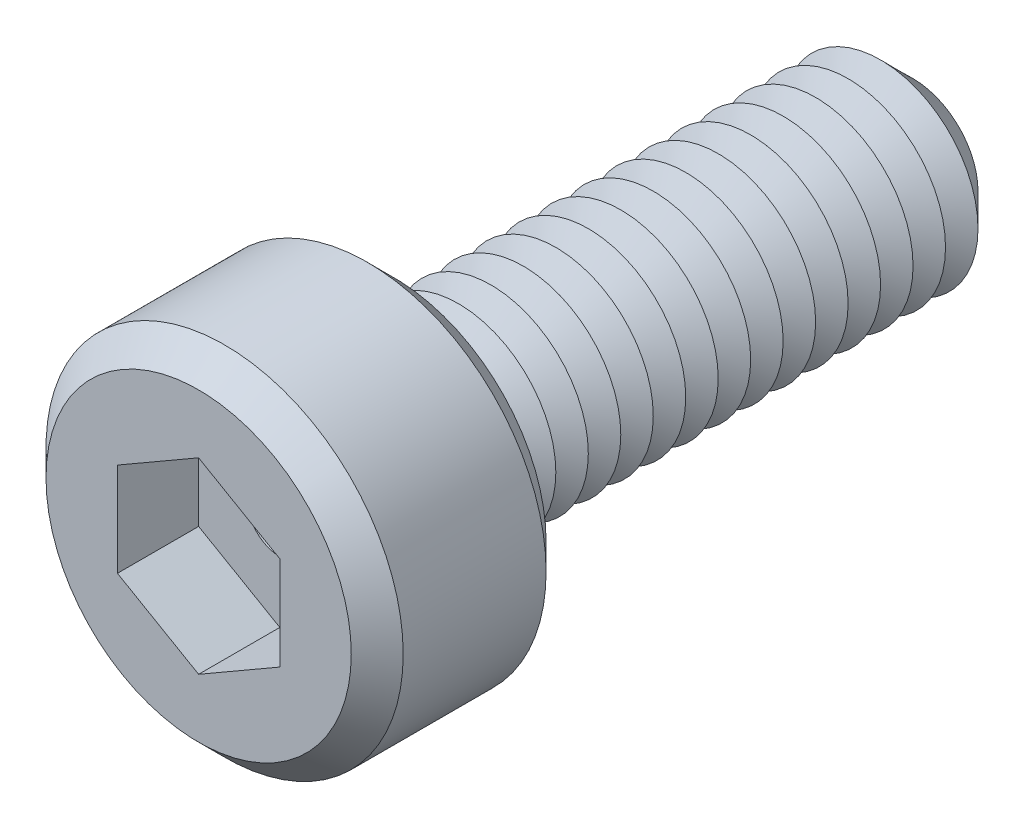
ISO-10303-21;
HEADER;
FILE_DESCRIPTION(('STEP AP214'),'2;1');
FILE_NAME('part.step','',(''),(''),'','','');
FILE_SCHEMA(('AUTOMOTIVE_DESIGN { 1 0 10303 214 1 1 1 1 }'));
ENDSEC;
DATA;
#1=APPLICATION_CONTEXT('core data for automotive mechanical design processes');
#2=APPLICATION_PROTOCOL_DEFINITION('international standard','automotive_design',2000,#1);
#3=PRODUCT_CONTEXT('',#1,'mechanical');
#4=PRODUCT('Part','Part','',(#3));
#5=PRODUCT_RELATED_PRODUCT_CATEGORY('part','',(#4));
#6=PRODUCT_DEFINITION_FORMATION('','',#4);
#7=PRODUCT_DEFINITION_CONTEXT('part definition',#1,'design');
#8=PRODUCT_DEFINITION('design','',#6,#7);
#9=PRODUCT_DEFINITION_SHAPE('','',#8);
#10=(LENGTH_UNIT() NAMED_UNIT(*) SI_UNIT(.MILLI.,.METRE.));
#11=(NAMED_UNIT(*) PLANE_ANGLE_UNIT() SI_UNIT($,.RADIAN.));
#12=(NAMED_UNIT(*) SI_UNIT($,.STERADIAN.) SOLID_ANGLE_UNIT());
#13=UNCERTAINTY_MEASURE_WITH_UNIT(LENGTH_MEASURE(1.E-05),#10,'distance_accuracy_value','');
#14=(GEOMETRIC_REPRESENTATION_CONTEXT(3) GLOBAL_UNCERTAINTY_ASSIGNED_CONTEXT((#13)) GLOBAL_UNIT_ASSIGNED_CONTEXT((#10,
#11,#12)) REPRESENTATION_CONTEXT('',''));
#15=CARTESIAN_POINT('',(0.,0.,0.));
#16=DIRECTION('',(0.,0.,1.));
#17=DIRECTION('',(1.,0.,0.));
#18=AXIS2_PLACEMENT_3D('',#15,#16,#17);
#19=CARTESIAN_POINT('',(0.,0.,3.));
#20=DIRECTION('',(0.,0.,-1.));
#21=DIRECTION('',(-1.,0.,0.));
#22=AXIS2_PLACEMENT_3D('',#19,#20,#21);
#23=CYLINDRICAL_SURFACE('',#22,2.75);
#24=CARTESIAN_POINT('',(0.,0.,0.4));
#25=DIRECTION('',(0.,0.,1.));
#26=DIRECTION('',(1.,0.,0.));
#27=AXIS2_PLACEMENT_3D('',#24,#25,#26);
#28=CIRCLE('',#27,2.75);
#29=CARTESIAN_POINT('',(2.75,0.,0.4));
#30=VERTEX_POINT('',#29);
#31=EDGE_CURVE('E297',#30,#30,#28,.T.);
#32=ORIENTED_EDGE('',*,*,#31,.T.);
#33=EDGE_LOOP('',(#32));
#34=FACE_BOUND('',#33,.T.);
#35=CARTESIAN_POINT('',(0.,0.,2.6));
#36=DIRECTION('',(0.,0.,1.));
#37=DIRECTION('',(1.,0.,0.));
#38=AXIS2_PLACEMENT_3D('',#35,#36,#37);
#39=CIRCLE('',#38,2.75);
#40=CARTESIAN_POINT('',(2.75,0.,2.6));
#41=VERTEX_POINT('',#40);
#42=EDGE_CURVE('E293',#41,#41,#39,.F.);
#43=ORIENTED_EDGE('',*,*,#42,.T.);
#44=EDGE_LOOP('',(#43));
#45=FACE_BOUND('',#44,.T.);
#46=ADVANCED_FACE('F39',(#34,#45),#23,.T.);
#47=CARTESIAN_POINT('',(0.,0.,3.));
#48=DIRECTION('',(0.,0.,1.));
#49=DIRECTION('',(1.,0.,0.));
#50=AXIS2_PLACEMENT_3D('',#47,#48,#49);
#51=PLANE('',#50);
#52=CARTESIAN_POINT('',(0.,0.,3.));
#53=DIRECTION('',(0.,0.,1.));
#54=DIRECTION('',(1.,0.,0.));
#55=AXIS2_PLACEMENT_3D('',#52,#53,#54);
#56=CIRCLE('',#55,2.35);
#57=CARTESIAN_POINT('',(2.35,0.,3.));
#58=VERTEX_POINT('',#57);
#59=EDGE_CURVE('E11',#58,#58,#56,.T.);
#60=ORIENTED_EDGE('',*,*,#59,.T.);
#61=EDGE_LOOP('',(#60));
#62=FACE_BOUND('',#61,.T.);
#63=DIRECTION('',(-0.866025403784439,0.5,0.));
#64=VECTOR('',#63,1.);
#65=CARTESIAN_POINT('',(1.25,0.721687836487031,3.));
#66=LINE('',#65,#64);
#67=CARTESIAN_POINT('',(1.25,0.721687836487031,3.));
#68=VERTEX_POINT('',#67);
#69=CARTESIAN_POINT('',(0.,1.44337567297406,3.));
#70=VERTEX_POINT('',#69);
#71=EDGE_CURVE('E55',#68,#70,#66,.T.);
#72=ORIENTED_EDGE('',*,*,#71,.F.);
#73=DIRECTION('',(0.,1.,0.));
#74=VECTOR('',#73,1.);
#75=CARTESIAN_POINT('',(1.25,-0.721687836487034,3.));
#76=LINE('',#75,#74);
#77=CARTESIAN_POINT('',(1.25,-0.721687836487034,3.));
#78=VERTEX_POINT('',#77);
#79=EDGE_CURVE('E151',#78,#68,#76,.T.);
#80=ORIENTED_EDGE('',*,*,#79,.F.);
#81=DIRECTION('',(0.866025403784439,0.5,0.));
#82=VECTOR('',#81,1.);
#83=CARTESIAN_POINT('',(0.,-1.44337567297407,3.));
#84=LINE('',#83,#82);
#85=CARTESIAN_POINT('',(0.,-1.44337567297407,3.));
#86=VERTEX_POINT('',#85);
#87=EDGE_CURVE('E148',#86,#78,#84,.T.);
#88=ORIENTED_EDGE('',*,*,#87,.F.);
#89=DIRECTION('',(0.866025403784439,-0.5,0.));
#90=VECTOR('',#89,1.);
#91=CARTESIAN_POINT('',(-1.25,-0.721687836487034,3.));
#92=LINE('',#91,#90);
#93=CARTESIAN_POINT('',(-1.25,-0.721687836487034,3.));
#94=VERTEX_POINT('',#93);
#95=EDGE_CURVE('E103',#94,#86,#92,.T.);
#96=ORIENTED_EDGE('',*,*,#95,.F.);
#97=DIRECTION('',(0.,-1.,0.));
#98=VECTOR('',#97,1.);
#99=CARTESIAN_POINT('',(-1.25,0.721687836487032,3.));
#100=LINE('',#99,#98);
#101=CARTESIAN_POINT('',(-1.25,0.721687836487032,3.));
#102=VERTEX_POINT('',#101);
#103=EDGE_CURVE('E142',#102,#94,#100,.T.);
#104=ORIENTED_EDGE('',*,*,#103,.F.);
#105=DIRECTION('',(-0.866025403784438,-0.5,0.));
#106=VECTOR('',#105,1.);
#107=CARTESIAN_POINT('',(0.,1.44337567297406,3.));
#108=LINE('',#107,#106);
#109=EDGE_CURVE('E137',#70,#102,#108,.T.);
#110=ORIENTED_EDGE('',*,*,#109,.F.);
#111=EDGE_LOOP('',(#72,#80,#88,#96,#104,#110));
#112=FACE_BOUND('',#111,.T.);
#113=ADVANCED_FACE('F315',(#62,#112),#51,.T.);
#114=CARTESIAN_POINT('',(0.,0.,0.));
#115=DIRECTION('',(0.,0.,1.));
#116=DIRECTION('',(1.,0.,0.));
#117=AXIS2_PLACEMENT_3D('',#114,#115,#116);
#118=PLANE('',#117);
#119=CARTESIAN_POINT('',(0.,0.,0.));
#120=DIRECTION('',(0.,0.,1.));
#121=DIRECTION('',(1.,0.,0.));
#122=AXIS2_PLACEMENT_3D('',#119,#120,#121);
#123=CIRCLE('',#122,2.35);
#124=CARTESIAN_POINT('',(2.35,0.,0.));
#125=VERTEX_POINT('',#124);
#126=EDGE_CURVE('E48',#125,#125,#123,.F.);
#127=ORIENTED_EDGE('',*,*,#126,.T.);
#128=EDGE_LOOP('',(#127));
#129=FACE_BOUND('',#128,.T.);
#130=CARTESIAN_POINT('',(0.,0.,0.));
#131=DIRECTION('',(0.,0.,1.));
#132=DIRECTION('',(1.,0.,0.));
#133=AXIS2_PLACEMENT_3D('',#130,#131,#132);
#134=CIRCLE('',#133,1.5);
#135=CARTESIAN_POINT('',(1.5,0.,0.));
#136=VERTEX_POINT('',#135);
#137=EDGE_CURVE('E285',#136,#136,#134,.T.);
#138=ORIENTED_EDGE('',*,*,#137,.T.);
#139=EDGE_LOOP('',(#138));
#140=FACE_BOUND('',#139,.T.);
#141=ADVANCED_FACE('F304',(#129,#140),#118,.F.);
#142=CARTESIAN_POINT('',(0.,0.,0.));
#143=DIRECTION('',(0.,0.,1.));
#144=DIRECTION('',(1.,0.,0.));
#145=AXIS2_PLACEMENT_3D('',#142,#143,#144);
#146=CONICAL_SURFACE('',#145,1.5,1.0471975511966);
#147=CARTESIAN_POINT('',(0.,0.,-0.250000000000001));
#148=DIRECTION('',(0.,0.,1.));
#149=DIRECTION('',(1.,0.,0.));
#150=AXIS2_PLACEMENT_3D('',#147,#148,#149);
#151=CIRCLE('',#150,1.06698729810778);
#152=CARTESIAN_POINT('',(1.06698729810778,0.,-0.250000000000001));
#153=VERTEX_POINT('',#152);
#154=EDGE_CURVE('E281',#153,#153,#151,.T.);
#155=ORIENTED_EDGE('',*,*,#154,.T.);
#156=EDGE_LOOP('',(#155));
#157=FACE_BOUND('',#156,.T.);
#158=ORIENTED_EDGE('',*,*,#137,.F.);
#159=EDGE_LOOP('',(#158));
#160=FACE_BOUND('',#159,.T.);
#161=ADVANCED_FACE('F484',(#157,#160),#146,.T.);
#162=CARTESIAN_POINT('',(0.,0.,-0.250000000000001));
#163=DIRECTION('',(0.,0.,-1.));
#164=DIRECTION('',(-1.,0.,0.));
#165=AXIS2_PLACEMENT_3D('',#162,#163,#164);
#166=CONICAL_SURFACE('',#165,1.06698729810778,1.0471975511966);
#167=CARTESIAN_POINT('',(0.,0.,-0.5));
#168=DIRECTION('',(0.,0.,1.));
#169=DIRECTION('',(1.,0.,0.));
#170=AXIS2_PLACEMENT_3D('',#167,#168,#169);
#171=CIRCLE('',#170,1.5);
#172=CARTESIAN_POINT('',(1.5,0.,-0.5));
#173=VERTEX_POINT('',#172);
#174=EDGE_CURVE('E277',#173,#173,#171,.T.);
#175=ORIENTED_EDGE('',*,*,#174,.T.);
#176=EDGE_LOOP('',(#175));
#177=FACE_BOUND('',#176,.T.);
#178=ORIENTED_EDGE('',*,*,#154,.F.);
#179=EDGE_LOOP('',(#178));
#180=FACE_BOUND('',#179,.T.);
#181=ADVANCED_FACE('F480',(#177,#180),#166,.T.);
#182=CARTESIAN_POINT('',(0.,0.,-0.5));
#183=DIRECTION('',(0.,0.,1.));
#184=DIRECTION('',(1.,0.,0.));
#185=AXIS2_PLACEMENT_3D('',#182,#183,#184);
#186=CONICAL_SURFACE('',#185,1.5,1.0471975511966);
#187=CARTESIAN_POINT('',(0.,0.,-0.750000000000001));
#188=DIRECTION('',(0.,0.,1.));
#189=DIRECTION('',(1.,0.,0.));
#190=AXIS2_PLACEMENT_3D('',#187,#188,#189);
#191=CIRCLE('',#190,1.06698729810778);
#192=CARTESIAN_POINT('',(1.06698729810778,0.,-0.750000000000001));
#193=VERTEX_POINT('',#192);
#194=EDGE_CURVE('E273',#193,#193,#191,.T.);
#195=ORIENTED_EDGE('',*,*,#194,.T.);
#196=EDGE_LOOP('',(#195));
#197=FACE_BOUND('',#196,.T.);
#198=ORIENTED_EDGE('',*,*,#174,.F.);
#199=EDGE_LOOP('',(#198));
#200=FACE_BOUND('',#199,.T.);
#201=ADVANCED_FACE('F476',(#197,#200),#186,.T.);
#202=CARTESIAN_POINT('',(0.,0.,-0.750000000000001));
#203=DIRECTION('',(0.,0.,-1.));
#204=DIRECTION('',(-1.,0.,0.));
#205=AXIS2_PLACEMENT_3D('',#202,#203,#204);
#206=CONICAL_SURFACE('',#205,1.06698729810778,1.0471975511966);
#207=CARTESIAN_POINT('',(0.,0.,-1.));
#208=DIRECTION('',(0.,0.,1.));
#209=DIRECTION('',(1.,0.,0.));
#210=AXIS2_PLACEMENT_3D('',#207,#208,#209);
#211=CIRCLE('',#210,1.5);
#212=CARTESIAN_POINT('',(1.5,0.,-1.));
#213=VERTEX_POINT('',#212);
#214=EDGE_CURVE('E269',#213,#213,#211,.T.);
#215=ORIENTED_EDGE('',*,*,#214,.T.);
#216=EDGE_LOOP('',(#215));
#217=FACE_BOUND('',#216,.T.);
#218=ORIENTED_EDGE('',*,*,#194,.F.);
#219=EDGE_LOOP('',(#218));
#220=FACE_BOUND('',#219,.T.);
#221=ADVANCED_FACE('F472',(#217,#220),#206,.T.);
#222=CARTESIAN_POINT('',(0.,0.,-1.));
#223=DIRECTION('',(0.,0.,1.));
#224=DIRECTION('',(1.,0.,0.));
#225=AXIS2_PLACEMENT_3D('',#222,#223,#224);
#226=CONICAL_SURFACE('',#225,1.5,1.0471975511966);
#227=CARTESIAN_POINT('',(0.,0.,-1.25));
#228=DIRECTION('',(0.,0.,1.));
#229=DIRECTION('',(1.,0.,0.));
#230=AXIS2_PLACEMENT_3D('',#227,#228,#229);
#231=CIRCLE('',#230,1.06698729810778);
#232=CARTESIAN_POINT('',(1.06698729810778,0.,-1.25));
#233=VERTEX_POINT('',#232);
#234=EDGE_CURVE('E265',#233,#233,#231,.T.);
#235=ORIENTED_EDGE('',*,*,#234,.T.);
#236=EDGE_LOOP('',(#235));
#237=FACE_BOUND('',#236,.T.);
#238=ORIENTED_EDGE('',*,*,#214,.F.);
#239=EDGE_LOOP('',(#238));
#240=FACE_BOUND('',#239,.T.);
#241=ADVANCED_FACE('F468',(#237,#240),#226,.T.);
#242=CARTESIAN_POINT('',(0.,0.,-1.25));
#243=DIRECTION('',(0.,0.,-1.));
#244=DIRECTION('',(-1.,0.,0.));
#245=AXIS2_PLACEMENT_3D('',#242,#243,#244);
#246=CONICAL_SURFACE('',#245,1.06698729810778,1.0471975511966);
#247=CARTESIAN_POINT('',(0.,0.,-1.5));
#248=DIRECTION('',(0.,0.,1.));
#249=DIRECTION('',(1.,0.,0.));
#250=AXIS2_PLACEMENT_3D('',#247,#248,#249);
#251=CIRCLE('',#250,1.5);
#252=CARTESIAN_POINT('',(1.5,0.,-1.5));
#253=VERTEX_POINT('',#252);
#254=EDGE_CURVE('E261',#253,#253,#251,.T.);
#255=ORIENTED_EDGE('',*,*,#254,.T.);
#256=EDGE_LOOP('',(#255));
#257=FACE_BOUND('',#256,.T.);
#258=ORIENTED_EDGE('',*,*,#234,.F.);
#259=EDGE_LOOP('',(#258));
#260=FACE_BOUND('',#259,.T.);
#261=ADVANCED_FACE('F464',(#257,#260),#246,.T.);
#262=CARTESIAN_POINT('',(0.,0.,-1.5));
#263=DIRECTION('',(0.,0.,1.));
#264=DIRECTION('',(1.,0.,0.));
#265=AXIS2_PLACEMENT_3D('',#262,#263,#264);
#266=CONICAL_SURFACE('',#265,1.5,1.0471975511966);
#267=CARTESIAN_POINT('',(0.,0.,-1.75));
#268=DIRECTION('',(0.,0.,1.));
#269=DIRECTION('',(1.,0.,0.));
#270=AXIS2_PLACEMENT_3D('',#267,#268,#269);
#271=CIRCLE('',#270,1.06698729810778);
#272=CARTESIAN_POINT('',(1.06698729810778,0.,-1.75));
#273=VERTEX_POINT('',#272);
#274=EDGE_CURVE('E257',#273,#273,#271,.T.);
#275=ORIENTED_EDGE('',*,*,#274,.T.);
#276=EDGE_LOOP('',(#275));
#277=FACE_BOUND('',#276,.T.);
#278=ORIENTED_EDGE('',*,*,#254,.F.);
#279=EDGE_LOOP('',(#278));
#280=FACE_BOUND('',#279,.T.);
#281=ADVANCED_FACE('F460',(#277,#280),#266,.T.);
#282=CARTESIAN_POINT('',(0.,0.,-1.75));
#283=DIRECTION('',(0.,0.,-1.));
#284=DIRECTION('',(-1.,0.,0.));
#285=AXIS2_PLACEMENT_3D('',#282,#283,#284);
#286=CONICAL_SURFACE('',#285,1.06698729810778,1.0471975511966);
#287=CARTESIAN_POINT('',(0.,0.,-2.));
#288=DIRECTION('',(0.,0.,1.));
#289=DIRECTION('',(1.,0.,0.));
#290=AXIS2_PLACEMENT_3D('',#287,#288,#289);
#291=CIRCLE('',#290,1.5);
#292=CARTESIAN_POINT('',(1.5,0.,-2.));
#293=VERTEX_POINT('',#292);
#294=EDGE_CURVE('E253',#293,#293,#291,.T.);
#295=ORIENTED_EDGE('',*,*,#294,.T.);
#296=EDGE_LOOP('',(#295));
#297=FACE_BOUND('',#296,.T.);
#298=ORIENTED_EDGE('',*,*,#274,.F.);
#299=EDGE_LOOP('',(#298));
#300=FACE_BOUND('',#299,.T.);
#301=ADVANCED_FACE('F456',(#297,#300),#286,.T.);
#302=CARTESIAN_POINT('',(0.,0.,-2.));
#303=DIRECTION('',(0.,0.,1.));
#304=DIRECTION('',(1.,0.,0.));
#305=AXIS2_PLACEMENT_3D('',#302,#303,#304);
#306=CONICAL_SURFACE('',#305,1.5,1.0471975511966);
#307=CARTESIAN_POINT('',(0.,0.,-2.25));
#308=DIRECTION('',(0.,0.,1.));
#309=DIRECTION('',(1.,0.,0.));
#310=AXIS2_PLACEMENT_3D('',#307,#308,#309);
#311=CIRCLE('',#310,1.06698729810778);
#312=CARTESIAN_POINT('',(1.06698729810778,0.,-2.25));
#313=VERTEX_POINT('',#312);
#314=EDGE_CURVE('E249',#313,#313,#311,.T.);
#315=ORIENTED_EDGE('',*,*,#314,.T.);
#316=EDGE_LOOP('',(#315));
#317=FACE_BOUND('',#316,.T.);
#318=ORIENTED_EDGE('',*,*,#294,.F.);
#319=EDGE_LOOP('',(#318));
#320=FACE_BOUND('',#319,.T.);
#321=ADVANCED_FACE('F452',(#317,#320),#306,.T.);
#322=CARTESIAN_POINT('',(0.,0.,-2.25));
#323=DIRECTION('',(0.,0.,-1.));
#324=DIRECTION('',(-1.,0.,0.));
#325=AXIS2_PLACEMENT_3D('',#322,#323,#324);
#326=CONICAL_SURFACE('',#325,1.06698729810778,1.0471975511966);
#327=CARTESIAN_POINT('',(0.,0.,-2.5));
#328=DIRECTION('',(0.,0.,1.));
#329=DIRECTION('',(1.,0.,0.));
#330=AXIS2_PLACEMENT_3D('',#327,#328,#329);
#331=CIRCLE('',#330,1.5);
#332=CARTESIAN_POINT('',(1.5,0.,-2.5));
#333=VERTEX_POINT('',#332);
#334=EDGE_CURVE('E245',#333,#333,#331,.T.);
#335=ORIENTED_EDGE('',*,*,#334,.T.);
#336=EDGE_LOOP('',(#335));
#337=FACE_BOUND('',#336,.T.);
#338=ORIENTED_EDGE('',*,*,#314,.F.);
#339=EDGE_LOOP('',(#338));
#340=FACE_BOUND('',#339,.T.);
#341=ADVANCED_FACE('F448',(#337,#340),#326,.T.);
#342=CARTESIAN_POINT('',(0.,0.,-2.5));
#343=DIRECTION('',(0.,0.,1.));
#344=DIRECTION('',(1.,0.,0.));
#345=AXIS2_PLACEMENT_3D('',#342,#343,#344);
#346=CONICAL_SURFACE('',#345,1.5,1.0471975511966);
#347=CARTESIAN_POINT('',(0.,0.,-2.75));
#348=DIRECTION('',(0.,0.,1.));
#349=DIRECTION('',(1.,0.,0.));
#350=AXIS2_PLACEMENT_3D('',#347,#348,#349);
#351=CIRCLE('',#350,1.06698729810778);
#352=CARTESIAN_POINT('',(1.06698729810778,0.,-2.75));
#353=VERTEX_POINT('',#352);
#354=EDGE_CURVE('E241',#353,#353,#351,.T.);
#355=ORIENTED_EDGE('',*,*,#354,.T.);
#356=EDGE_LOOP('',(#355));
#357=FACE_BOUND('',#356,.T.);
#358=ORIENTED_EDGE('',*,*,#334,.F.);
#359=EDGE_LOOP('',(#358));
#360=FACE_BOUND('',#359,.T.);
#361=ADVANCED_FACE('F444',(#357,#360),#346,.T.);
#362=CARTESIAN_POINT('',(0.,0.,-2.75));
#363=DIRECTION('',(0.,0.,-1.));
#364=DIRECTION('',(-1.,0.,0.));
#365=AXIS2_PLACEMENT_3D('',#362,#363,#364);
#366=CONICAL_SURFACE('',#365,1.06698729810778,1.0471975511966);
#367=CARTESIAN_POINT('',(0.,0.,-3.));
#368=DIRECTION('',(0.,0.,1.));
#369=DIRECTION('',(1.,0.,0.));
#370=AXIS2_PLACEMENT_3D('',#367,#368,#369);
#371=CIRCLE('',#370,1.5);
#372=CARTESIAN_POINT('',(1.5,0.,-3.));
#373=VERTEX_POINT('',#372);
#374=EDGE_CURVE('E237',#373,#373,#371,.T.);
#375=ORIENTED_EDGE('',*,*,#374,.T.);
#376=EDGE_LOOP('',(#375));
#377=FACE_BOUND('',#376,.T.);
#378=ORIENTED_EDGE('',*,*,#354,.F.);
#379=EDGE_LOOP('',(#378));
#380=FACE_BOUND('',#379,.T.);
#381=ADVANCED_FACE('F440',(#377,#380),#366,.T.);
#382=CARTESIAN_POINT('',(0.,0.,-3.));
#383=DIRECTION('',(0.,0.,1.));
#384=DIRECTION('',(1.,0.,0.));
#385=AXIS2_PLACEMENT_3D('',#382,#383,#384);
#386=CONICAL_SURFACE('',#385,1.5,1.0471975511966);
#387=CARTESIAN_POINT('',(0.,0.,-3.25));
#388=DIRECTION('',(0.,0.,1.));
#389=DIRECTION('',(1.,0.,0.));
#390=AXIS2_PLACEMENT_3D('',#387,#388,#389);
#391=CIRCLE('',#390,1.06698729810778);
#392=CARTESIAN_POINT('',(1.06698729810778,0.,-3.25));
#393=VERTEX_POINT('',#392);
#394=EDGE_CURVE('E233',#393,#393,#391,.T.);
#395=ORIENTED_EDGE('',*,*,#394,.T.);
#396=EDGE_LOOP('',(#395));
#397=FACE_BOUND('',#396,.T.);
#398=ORIENTED_EDGE('',*,*,#374,.F.);
#399=EDGE_LOOP('',(#398));
#400=FACE_BOUND('',#399,.T.);
#401=ADVANCED_FACE('F436',(#397,#400),#386,.T.);
#402=CARTESIAN_POINT('',(0.,0.,-3.25));
#403=DIRECTION('',(0.,0.,-1.));
#404=DIRECTION('',(-1.,0.,0.));
#405=AXIS2_PLACEMENT_3D('',#402,#403,#404);
#406=CONICAL_SURFACE('',#405,1.06698729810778,1.0471975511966);
#407=CARTESIAN_POINT('',(0.,0.,-3.5));
#408=DIRECTION('',(0.,0.,1.));
#409=DIRECTION('',(1.,0.,0.));
#410=AXIS2_PLACEMENT_3D('',#407,#408,#409);
#411=CIRCLE('',#410,1.5);
#412=CARTESIAN_POINT('',(1.5,0.,-3.5));
#413=VERTEX_POINT('',#412);
#414=EDGE_CURVE('E229',#413,#413,#411,.T.);
#415=ORIENTED_EDGE('',*,*,#414,.T.);
#416=EDGE_LOOP('',(#415));
#417=FACE_BOUND('',#416,.T.);
#418=ORIENTED_EDGE('',*,*,#394,.F.);
#419=EDGE_LOOP('',(#418));
#420=FACE_BOUND('',#419,.T.);
#421=ADVANCED_FACE('F432',(#417,#420),#406,.T.);
#422=CARTESIAN_POINT('',(0.,0.,-3.5));
#423=DIRECTION('',(0.,0.,1.));
#424=DIRECTION('',(1.,0.,0.));
#425=AXIS2_PLACEMENT_3D('',#422,#423,#424);
#426=CONICAL_SURFACE('',#425,1.5,1.0471975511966);
#427=CARTESIAN_POINT('',(0.,0.,-3.75));
#428=DIRECTION('',(0.,0.,1.));
#429=DIRECTION('',(1.,0.,0.));
#430=AXIS2_PLACEMENT_3D('',#427,#428,#429);
#431=CIRCLE('',#430,1.06698729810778);
#432=CARTESIAN_POINT('',(1.06698729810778,0.,-3.75));
#433=VERTEX_POINT('',#432);
#434=EDGE_CURVE('E225',#433,#433,#431,.T.);
#435=ORIENTED_EDGE('',*,*,#434,.T.);
#436=EDGE_LOOP('',(#435));
#437=FACE_BOUND('',#436,.T.);
#438=ORIENTED_EDGE('',*,*,#414,.F.);
#439=EDGE_LOOP('',(#438));
#440=FACE_BOUND('',#439,.T.);
#441=ADVANCED_FACE('F428',(#437,#440),#426,.T.);
#442=CARTESIAN_POINT('',(0.,0.,-3.75));
#443=DIRECTION('',(0.,0.,-1.));
#444=DIRECTION('',(-1.,0.,0.));
#445=AXIS2_PLACEMENT_3D('',#442,#443,#444);
#446=CONICAL_SURFACE('',#445,1.06698729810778,1.0471975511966);
#447=CARTESIAN_POINT('',(0.,0.,-4.));
#448=DIRECTION('',(0.,0.,1.));
#449=DIRECTION('',(1.,0.,0.));
#450=AXIS2_PLACEMENT_3D('',#447,#448,#449);
#451=CIRCLE('',#450,1.5);
#452=CARTESIAN_POINT('',(1.5,0.,-4.));
#453=VERTEX_POINT('',#452);
#454=EDGE_CURVE('E221',#453,#453,#451,.T.);
#455=ORIENTED_EDGE('',*,*,#454,.T.);
#456=EDGE_LOOP('',(#455));
#457=FACE_BOUND('',#456,.T.);
#458=ORIENTED_EDGE('',*,*,#434,.F.);
#459=EDGE_LOOP('',(#458));
#460=FACE_BOUND('',#459,.T.);
#461=ADVANCED_FACE('F424',(#457,#460),#446,.T.);
#462=CARTESIAN_POINT('',(0.,0.,-4.));
#463=DIRECTION('',(0.,0.,1.));
#464=DIRECTION('',(1.,0.,0.));
#465=AXIS2_PLACEMENT_3D('',#462,#463,#464);
#466=CONICAL_SURFACE('',#465,1.5,1.0471975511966);
#467=CARTESIAN_POINT('',(0.,0.,-4.25));
#468=DIRECTION('',(0.,0.,1.));
#469=DIRECTION('',(1.,0.,0.));
#470=AXIS2_PLACEMENT_3D('',#467,#468,#469);
#471=CIRCLE('',#470,1.06698729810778);
#472=CARTESIAN_POINT('',(1.06698729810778,0.,-4.25));
#473=VERTEX_POINT('',#472);
#474=EDGE_CURVE('E217',#473,#473,#471,.T.);
#475=ORIENTED_EDGE('',*,*,#474,.T.);
#476=EDGE_LOOP('',(#475));
#477=FACE_BOUND('',#476,.T.);
#478=ORIENTED_EDGE('',*,*,#454,.F.);
#479=EDGE_LOOP('',(#478));
#480=FACE_BOUND('',#479,.T.);
#481=ADVANCED_FACE('F420',(#477,#480),#466,.T.);
#482=CARTESIAN_POINT('',(0.,0.,-4.25));
#483=DIRECTION('',(0.,0.,-1.));
#484=DIRECTION('',(-1.,0.,0.));
#485=AXIS2_PLACEMENT_3D('',#482,#483,#484);
#486=CONICAL_SURFACE('',#485,1.06698729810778,1.0471975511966);
#487=CARTESIAN_POINT('',(0.,0.,-4.5));
#488=DIRECTION('',(0.,0.,1.));
#489=DIRECTION('',(1.,0.,0.));
#490=AXIS2_PLACEMENT_3D('',#487,#488,#489);
#491=CIRCLE('',#490,1.5);
#492=CARTESIAN_POINT('',(1.5,0.,-4.5));
#493=VERTEX_POINT('',#492);
#494=EDGE_CURVE('E213',#493,#493,#491,.T.);
#495=ORIENTED_EDGE('',*,*,#494,.T.);
#496=EDGE_LOOP('',(#495));
#497=FACE_BOUND('',#496,.T.);
#498=ORIENTED_EDGE('',*,*,#474,.F.);
#499=EDGE_LOOP('',(#498));
#500=FACE_BOUND('',#499,.T.);
#501=ADVANCED_FACE('F416',(#497,#500),#486,.T.);
#502=CARTESIAN_POINT('',(0.,0.,-4.5));
#503=DIRECTION('',(0.,0.,1.));
#504=DIRECTION('',(1.,0.,0.));
#505=AXIS2_PLACEMENT_3D('',#502,#503,#504);
#506=CONICAL_SURFACE('',#505,1.5,1.0471975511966);
#507=CARTESIAN_POINT('',(0.,0.,-4.75));
#508=DIRECTION('',(0.,0.,1.));
#509=DIRECTION('',(1.,0.,0.));
#510=AXIS2_PLACEMENT_3D('',#507,#508,#509);
#511=CIRCLE('',#510,1.06698729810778);
#512=CARTESIAN_POINT('',(1.06698729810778,0.,-4.75));
#513=VERTEX_POINT('',#512);
#514=EDGE_CURVE('E209',#513,#513,#511,.T.);
#515=ORIENTED_EDGE('',*,*,#514,.T.);
#516=EDGE_LOOP('',(#515));
#517=FACE_BOUND('',#516,.T.);
#518=ORIENTED_EDGE('',*,*,#494,.F.);
#519=EDGE_LOOP('',(#518));
#520=FACE_BOUND('',#519,.T.);
#521=ADVANCED_FACE('F412',(#517,#520),#506,.T.);
#522=CARTESIAN_POINT('',(0.,0.,-4.75));
#523=DIRECTION('',(0.,0.,-1.));
#524=DIRECTION('',(-1.,0.,0.));
#525=AXIS2_PLACEMENT_3D('',#522,#523,#524);
#526=CONICAL_SURFACE('',#525,1.06698729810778,1.0471975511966);
#527=CARTESIAN_POINT('',(0.,0.,-5.));
#528=DIRECTION('',(0.,0.,1.));
#529=DIRECTION('',(1.,0.,0.));
#530=AXIS2_PLACEMENT_3D('',#527,#528,#529);
#531=CIRCLE('',#530,1.5);
#532=CARTESIAN_POINT('',(1.5,0.,-5.));
#533=VERTEX_POINT('',#532);
#534=EDGE_CURVE('E205',#533,#533,#531,.T.);
#535=ORIENTED_EDGE('',*,*,#534,.T.);
#536=EDGE_LOOP('',(#535));
#537=FACE_BOUND('',#536,.T.);
#538=ORIENTED_EDGE('',*,*,#514,.F.);
#539=EDGE_LOOP('',(#538));
#540=FACE_BOUND('',#539,.T.);
#541=ADVANCED_FACE('F408',(#537,#540),#526,.T.);
#542=CARTESIAN_POINT('',(0.,0.,-5.));
#543=DIRECTION('',(0.,0.,1.));
#544=DIRECTION('',(1.,0.,0.));
#545=AXIS2_PLACEMENT_3D('',#542,#543,#544);
#546=CONICAL_SURFACE('',#545,1.5,1.0471975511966);
#547=CARTESIAN_POINT('',(0.,0.,-5.25));
#548=DIRECTION('',(0.,0.,1.));
#549=DIRECTION('',(1.,0.,0.));
#550=AXIS2_PLACEMENT_3D('',#547,#548,#549);
#551=CIRCLE('',#550,1.06698729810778);
#552=CARTESIAN_POINT('',(1.06698729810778,0.,-5.25));
#553=VERTEX_POINT('',#552);
#554=EDGE_CURVE('E201',#553,#553,#551,.T.);
#555=ORIENTED_EDGE('',*,*,#554,.T.);
#556=EDGE_LOOP('',(#555));
#557=FACE_BOUND('',#556,.T.);
#558=ORIENTED_EDGE('',*,*,#534,.F.);
#559=EDGE_LOOP('',(#558));
#560=FACE_BOUND('',#559,.T.);
#561=ADVANCED_FACE('F404',(#557,#560),#546,.T.);
#562=CARTESIAN_POINT('',(0.,0.,-5.25));
#563=DIRECTION('',(0.,0.,-1.));
#564=DIRECTION('',(-1.,0.,0.));
#565=AXIS2_PLACEMENT_3D('',#562,#563,#564);
#566=CONICAL_SURFACE('',#565,1.06698729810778,1.0471975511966);
#567=CARTESIAN_POINT('',(0.,0.,-5.5));
#568=DIRECTION('',(0.,0.,1.));
#569=DIRECTION('',(1.,0.,0.));
#570=AXIS2_PLACEMENT_3D('',#567,#568,#569);
#571=CIRCLE('',#570,1.5);
#572=CARTESIAN_POINT('',(1.5,0.,-5.5));
#573=VERTEX_POINT('',#572);
#574=EDGE_CURVE('E197',#573,#573,#571,.T.);
#575=ORIENTED_EDGE('',*,*,#574,.T.);
#576=EDGE_LOOP('',(#575));
#577=FACE_BOUND('',#576,.T.);
#578=ORIENTED_EDGE('',*,*,#554,.F.);
#579=EDGE_LOOP('',(#578));
#580=FACE_BOUND('',#579,.T.);
#581=ADVANCED_FACE('F400',(#577,#580),#566,.T.);
#582=CARTESIAN_POINT('',(0.,0.,-5.5));
#583=DIRECTION('',(0.,0.,1.));
#584=DIRECTION('',(1.,0.,0.));
#585=AXIS2_PLACEMENT_3D('',#582,#583,#584);
#586=CONICAL_SURFACE('',#585,1.5,1.0471975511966);
#587=CARTESIAN_POINT('',(0.,0.,-5.75));
#588=DIRECTION('',(0.,0.,1.));
#589=DIRECTION('',(1.,0.,0.));
#590=AXIS2_PLACEMENT_3D('',#587,#588,#589);
#591=CIRCLE('',#590,1.06698729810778);
#592=CARTESIAN_POINT('',(1.06698729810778,0.,-5.75));
#593=VERTEX_POINT('',#592);
#594=EDGE_CURVE('E193',#593,#593,#591,.T.);
#595=ORIENTED_EDGE('',*,*,#594,.T.);
#596=EDGE_LOOP('',(#595));
#597=FACE_BOUND('',#596,.T.);
#598=ORIENTED_EDGE('',*,*,#574,.F.);
#599=EDGE_LOOP('',(#598));
#600=FACE_BOUND('',#599,.T.);
#601=ADVANCED_FACE('F396',(#597,#600),#586,.T.);
#602=CARTESIAN_POINT('',(0.,0.,-5.75));
#603=DIRECTION('',(0.,0.,-1.));
#604=DIRECTION('',(-1.,0.,0.));
#605=AXIS2_PLACEMENT_3D('',#602,#603,#604);
#606=CONICAL_SURFACE('',#605,1.06698729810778,1.0471975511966);
#607=CARTESIAN_POINT('',(0.,0.,-6.));
#608=DIRECTION('',(0.,0.,1.));
#609=DIRECTION('',(1.,0.,0.));
#610=AXIS2_PLACEMENT_3D('',#607,#608,#609);
#611=CIRCLE('',#610,1.5);
#612=CARTESIAN_POINT('',(1.5,0.,-6.));
#613=VERTEX_POINT('',#612);
#614=EDGE_CURVE('E189',#613,#613,#611,.T.);
#615=ORIENTED_EDGE('',*,*,#614,.T.);
#616=EDGE_LOOP('',(#615));
#617=FACE_BOUND('',#616,.T.);
#618=ORIENTED_EDGE('',*,*,#594,.F.);
#619=EDGE_LOOP('',(#618));
#620=FACE_BOUND('',#619,.T.);
#621=ADVANCED_FACE('F392',(#617,#620),#606,.T.);
#622=CARTESIAN_POINT('',(0.,0.,-6.));
#623=DIRECTION('',(0.,0.,1.));
#624=DIRECTION('',(1.,0.,0.));
#625=AXIS2_PLACEMENT_3D('',#622,#623,#624);
#626=CONICAL_SURFACE('',#625,1.5,1.0471975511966);
#627=CARTESIAN_POINT('',(0.,0.,-6.25));
#628=DIRECTION('',(0.,0.,1.));
#629=DIRECTION('',(1.,0.,0.));
#630=AXIS2_PLACEMENT_3D('',#627,#628,#629);
#631=CIRCLE('',#630,1.06698729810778);
#632=CARTESIAN_POINT('',(1.06698729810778,0.,-6.25));
#633=VERTEX_POINT('',#632);
#634=EDGE_CURVE('E185',#633,#633,#631,.T.);
#635=ORIENTED_EDGE('',*,*,#634,.T.);
#636=EDGE_LOOP('',(#635));
#637=FACE_BOUND('',#636,.T.);
#638=ORIENTED_EDGE('',*,*,#614,.F.);
#639=EDGE_LOOP('',(#638));
#640=FACE_BOUND('',#639,.T.);
#641=ADVANCED_FACE('F388',(#637,#640),#626,.T.);
#642=CARTESIAN_POINT('',(0.,0.,-6.25));
#643=DIRECTION('',(0.,0.,-1.));
#644=DIRECTION('',(-1.,0.,0.));
#645=AXIS2_PLACEMENT_3D('',#642,#643,#644);
#646=CONICAL_SURFACE('',#645,1.06698729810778,1.0471975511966);
#647=CARTESIAN_POINT('',(0.,0.,-6.5));
#648=DIRECTION('',(0.,0.,1.));
#649=DIRECTION('',(1.,0.,0.));
#650=AXIS2_PLACEMENT_3D('',#647,#648,#649);
#651=CIRCLE('',#650,1.5);
#652=CARTESIAN_POINT('',(1.5,0.,-6.5));
#653=VERTEX_POINT('',#652);
#654=EDGE_CURVE('E181',#653,#653,#651,.T.);
#655=ORIENTED_EDGE('',*,*,#654,.T.);
#656=EDGE_LOOP('',(#655));
#657=FACE_BOUND('',#656,.T.);
#658=ORIENTED_EDGE('',*,*,#634,.F.);
#659=EDGE_LOOP('',(#658));
#660=FACE_BOUND('',#659,.T.);
#661=ADVANCED_FACE('F384',(#657,#660),#646,.T.);
#662=CARTESIAN_POINT('',(0.,0.,-6.5));
#663=DIRECTION('',(0.,0.,1.));
#664=DIRECTION('',(1.,0.,0.));
#665=AXIS2_PLACEMENT_3D('',#662,#663,#664);
#666=CONICAL_SURFACE('',#665,1.5,1.0471975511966);
#667=CARTESIAN_POINT('',(0.,0.,-6.75));
#668=DIRECTION('',(0.,0.,1.));
#669=DIRECTION('',(1.,0.,0.));
#670=AXIS2_PLACEMENT_3D('',#667,#668,#669);
#671=CIRCLE('',#670,1.06698729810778);
#672=CARTESIAN_POINT('',(1.06698729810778,0.,-6.75));
#673=VERTEX_POINT('',#672);
#674=EDGE_CURVE('E177',#673,#673,#671,.T.);
#675=ORIENTED_EDGE('',*,*,#674,.T.);
#676=EDGE_LOOP('',(#675));
#677=FACE_BOUND('',#676,.T.);
#678=ORIENTED_EDGE('',*,*,#654,.F.);
#679=EDGE_LOOP('',(#678));
#680=FACE_BOUND('',#679,.T.);
#681=ADVANCED_FACE('F380',(#677,#680),#666,.T.);
#682=CARTESIAN_POINT('',(0.,0.,-6.75));
#683=DIRECTION('',(0.,0.,-1.));
#684=DIRECTION('',(-1.,0.,0.));
#685=AXIS2_PLACEMENT_3D('',#682,#683,#684);
#686=CONICAL_SURFACE('',#685,1.06698729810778,1.0471975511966);
#687=CARTESIAN_POINT('',(0.,0.,-7.));
#688=DIRECTION('',(0.,0.,1.));
#689=DIRECTION('',(1.,0.,0.));
#690=AXIS2_PLACEMENT_3D('',#687,#688,#689);
#691=CIRCLE('',#690,1.5);
#692=CARTESIAN_POINT('',(1.5,0.,-7.));
#693=VERTEX_POINT('',#692);
#694=EDGE_CURVE('E174',#693,#693,#691,.T.);
#695=ORIENTED_EDGE('',*,*,#694,.T.);
#696=EDGE_LOOP('',(#695));
#697=FACE_BOUND('',#696,.T.);
#698=ORIENTED_EDGE('',*,*,#674,.F.);
#699=EDGE_LOOP('',(#698));
#700=FACE_BOUND('',#699,.T.);
#701=ADVANCED_FACE('F376',(#697,#700),#686,.T.);
#702=CARTESIAN_POINT('',(0.,0.,-7.));
#703=DIRECTION('',(0.,0.,1.));
#704=DIRECTION('',(1.,0.,0.));
#705=AXIS2_PLACEMENT_3D('',#702,#703,#704);
#706=CONICAL_SURFACE('',#705,1.5,1.0471975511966);
#707=CARTESIAN_POINT('',(0.,0.,-7.25));
#708=DIRECTION('',(0.,0.,1.));
#709=DIRECTION('',(1.,0.,0.));
#710=AXIS2_PLACEMENT_3D('',#707,#708,#709);
#711=CIRCLE('',#710,1.06698729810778);
#712=CARTESIAN_POINT('',(1.06698729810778,0.,-7.25));
#713=VERTEX_POINT('',#712);
#714=EDGE_CURVE('E170',#713,#713,#711,.T.);
#715=ORIENTED_EDGE('',*,*,#714,.T.);
#716=EDGE_LOOP('',(#715));
#717=FACE_BOUND('',#716,.T.);
#718=ORIENTED_EDGE('',*,*,#694,.F.);
#719=EDGE_LOOP('',(#718));
#720=FACE_BOUND('',#719,.T.);
#721=ADVANCED_FACE('F372',(#717,#720),#706,.T.);
#722=CARTESIAN_POINT('',(0.,0.,-7.25));
#723=DIRECTION('',(0.,0.,-1.));
#724=DIRECTION('',(-1.,0.,0.));
#725=AXIS2_PLACEMENT_3D('',#722,#723,#724);
#726=CONICAL_SURFACE('',#725,1.06698729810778,1.0471975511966);
#727=CARTESIAN_POINT('',(0.,0.,-7.5));
#728=DIRECTION('',(0.,0.,1.));
#729=DIRECTION('',(1.,0.,0.));
#730=AXIS2_PLACEMENT_3D('',#727,#728,#729);
#731=CIRCLE('',#730,1.5);
#732=CARTESIAN_POINT('',(1.5,0.,-7.5));
#733=VERTEX_POINT('',#732);
#734=EDGE_CURVE('E157',#733,#733,#731,.T.);
#735=ORIENTED_EDGE('',*,*,#734,.T.);
#736=EDGE_LOOP('',(#735));
#737=FACE_BOUND('',#736,.T.);
#738=ORIENTED_EDGE('',*,*,#714,.F.);
#739=EDGE_LOOP('',(#738));
#740=FACE_BOUND('',#739,.T.);
#741=ADVANCED_FACE('F368',(#737,#740),#726,.T.);
#742=CARTESIAN_POINT('',(0.,0.,-8.));
#743=DIRECTION('',(0.,0.,-1.));
#744=DIRECTION('',(-1.,0.,0.));
#745=AXIS2_PLACEMENT_3D('',#742,#743,#744);
#746=PLANE('',#745);
#747=CARTESIAN_POINT('',(0.,0.,-8.));
#748=DIRECTION('',(0.,0.,-1.));
#749=DIRECTION('',(-1.,0.,0.));
#750=AXIS2_PLACEMENT_3D('',#747,#748,#749);
#751=CIRCLE('',#750,0.5);
#752=CARTESIAN_POINT('',(-0.5,0.,-8.));
#753=VERTEX_POINT('',#752);
#754=EDGE_CURVE('E138',#753,#753,#751,.F.);
#755=ORIENTED_EDGE('',*,*,#754,.T.);
#756=EDGE_LOOP('',(#755));
#757=FACE_BOUND('',#756,.T.);
#758=CARTESIAN_POINT('',(0.,0.,-8.));
#759=DIRECTION('',(0.,0.,-1.));
#760=DIRECTION('',(-1.,0.,0.));
#761=AXIS2_PLACEMENT_3D('',#758,#759,#760);
#762=CIRCLE('',#761,0.999999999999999);
#763=CARTESIAN_POINT('',(-0.999999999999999,0.,-8.));
#764=VERTEX_POINT('',#763);
#765=EDGE_CURVE('E289',#764,#764,#762,.T.);
#766=ORIENTED_EDGE('',*,*,#765,.T.);
#767=EDGE_LOOP('',(#766));
#768=FACE_BOUND('',#767,.T.);
#769=ADVANCED_FACE('F371',(#757,#768),#746,.T.);
#770=CARTESIAN_POINT('',(0.,0.,-8.));
#771=DIRECTION('',(0.,0.,1.));
#772=DIRECTION('',(1.,0.,0.));
#773=AXIS2_PLACEMENT_3D('',#770,#771,#772);
#774=CONICAL_SURFACE('',#773,0.999999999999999,0.785398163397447);
#775=ORIENTED_EDGE('',*,*,#734,.F.);
#776=EDGE_LOOP('',(#775));
#777=FACE_BOUND('',#776,.T.);
#778=ORIENTED_EDGE('',*,*,#765,.F.);
#779=EDGE_LOOP('',(#778));
#780=FACE_BOUND('',#779,.T.);
#781=ADVANCED_FACE('F367',(#777,#780),#774,.T.);
#782=CARTESIAN_POINT('',(1.25,0.721687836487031,1.75));
#783=DIRECTION('',(0.5,0.866025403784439,0.));
#784=DIRECTION('',(-0.866025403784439,0.5,0.));
#785=AXIS2_PLACEMENT_3D('',#782,#783,#784);
#786=PLANE('',#785);
#787=ORIENTED_EDGE('',*,*,#71,.T.);
#788=DIRECTION('',(0.,0.,1.));
#789=VECTOR('',#788,1.);
#790=CARTESIAN_POINT('',(0.,1.44337567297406,1.75));
#791=LINE('',#790,#789);
#792=CARTESIAN_POINT('',(0.,1.44337567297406,1.75));
#793=VERTEX_POINT('',#792);
#794=EDGE_CURVE('E85',#793,#70,#791,.T.);
#795=ORIENTED_EDGE('',*,*,#794,.F.);
#796=DIRECTION('',(-0.866025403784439,0.5,0.));
#797=VECTOR('',#796,1.);
#798=CARTESIAN_POINT('',(1.25,0.721687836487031,1.75));
#799=LINE('',#798,#797);
#800=CARTESIAN_POINT('',(1.25,0.721687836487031,1.75));
#801=VERTEX_POINT('',#800);
#802=EDGE_CURVE('E154',#801,#793,#799,.T.);
#803=ORIENTED_EDGE('',*,*,#802,.F.);
#804=DIRECTION('',(0.,0.,1.));
#805=VECTOR('',#804,1.);
#806=CARTESIAN_POINT('',(1.25,0.721687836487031,1.75));
#807=LINE('',#806,#805);
#808=EDGE_CURVE('E63',#801,#68,#807,.T.);
#809=ORIENTED_EDGE('',*,*,#808,.T.);
#810=EDGE_LOOP('',(#787,#795,#803,#809));
#811=FACE_BOUND('',#810,.T.);
#812=ADVANCED_FACE('F357',(#811),#786,.F.);
#813=CARTESIAN_POINT('',(1.25,-0.721687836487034,1.75));
#814=DIRECTION('',(1.,0.,0.));
#815=DIRECTION('',(0.,1.,0.));
#816=AXIS2_PLACEMENT_3D('',#813,#814,#815);
#817=PLANE('',#816);
#818=ORIENTED_EDGE('',*,*,#79,.T.);
#819=ORIENTED_EDGE('',*,*,#808,.F.);
#820=DIRECTION('',(0.,1.,0.));
#821=VECTOR('',#820,1.);
#822=CARTESIAN_POINT('',(1.25,-0.721687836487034,1.75));
#823=LINE('',#822,#821);
#824=CARTESIAN_POINT('',(1.25,-0.721687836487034,1.75));
#825=VERTEX_POINT('',#824);
#826=EDGE_CURVE('E117',#825,#801,#823,.T.);
#827=ORIENTED_EDGE('',*,*,#826,.F.);
#828=DIRECTION('',(0.,0.,1.));
#829=VECTOR('',#828,1.);
#830=CARTESIAN_POINT('',(1.25,-0.721687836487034,1.75));
#831=LINE('',#830,#829);
#832=EDGE_CURVE('E108',#825,#78,#831,.T.);
#833=ORIENTED_EDGE('',*,*,#832,.T.);
#834=EDGE_LOOP('',(#818,#819,#827,#833));
#835=FACE_BOUND('',#834,.T.);
#836=ADVANCED_FACE('F354',(#835),#817,.F.);
#837=CARTESIAN_POINT('',(0.,-1.44337567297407,1.75));
#838=DIRECTION('',(0.5,-0.866025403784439,0.));
#839=DIRECTION('',(0.866025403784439,0.5,0.));
#840=AXIS2_PLACEMENT_3D('',#837,#838,#839);
#841=PLANE('',#840);
#842=ORIENTED_EDGE('',*,*,#87,.T.);
#843=ORIENTED_EDGE('',*,*,#832,.F.);
#844=DIRECTION('',(0.866025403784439,0.5,0.));
#845=VECTOR('',#844,1.);
#846=CARTESIAN_POINT('',(0.,-1.44337567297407,1.75));
#847=LINE('',#846,#845);
#848=CARTESIAN_POINT('',(0.,-1.44337567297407,1.75));
#849=VERTEX_POINT('',#848);
#850=EDGE_CURVE('E112',#849,#825,#847,.T.);
#851=ORIENTED_EDGE('',*,*,#850,.F.);
#852=DIRECTION('',(0.,0.,1.));
#853=VECTOR('',#852,1.);
#854=CARTESIAN_POINT('',(0.,-1.44337567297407,1.75));
#855=LINE('',#854,#853);
#856=EDGE_CURVE('E96',#849,#86,#855,.T.);
#857=ORIENTED_EDGE('',*,*,#856,.T.);
#858=EDGE_LOOP('',(#842,#843,#851,#857));
#859=FACE_BOUND('',#858,.T.);
#860=ADVANCED_FACE('F113',(#859),#841,.F.);
#861=CARTESIAN_POINT('',(-1.25,-0.721687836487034,1.75));
#862=DIRECTION('',(-0.5,-0.866025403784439,0.));
#863=DIRECTION('',(0.866025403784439,-0.5,0.));
#864=AXIS2_PLACEMENT_3D('',#861,#862,#863);
#865=PLANE('',#864);
#866=ORIENTED_EDGE('',*,*,#95,.T.);
#867=ORIENTED_EDGE('',*,*,#856,.F.);
#868=DIRECTION('',(0.866025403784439,-0.5,0.));
#869=VECTOR('',#868,1.);
#870=CARTESIAN_POINT('',(-1.25,-0.721687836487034,1.75));
#871=LINE('',#870,#869);
#872=CARTESIAN_POINT('',(-1.25,-0.721687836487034,1.75));
#873=VERTEX_POINT('',#872);
#874=EDGE_CURVE('E100',#873,#849,#871,.T.);
#875=ORIENTED_EDGE('',*,*,#874,.F.);
#876=DIRECTION('',(0.,0.,1.));
#877=VECTOR('',#876,1.);
#878=CARTESIAN_POINT('',(-1.25,-0.721687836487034,1.75));
#879=LINE('',#878,#877);
#880=EDGE_CURVE('E109',#873,#94,#879,.T.);
#881=ORIENTED_EDGE('',*,*,#880,.T.);
#882=EDGE_LOOP('',(#866,#867,#875,#881));
#883=FACE_BOUND('',#882,.T.);
#884=ADVANCED_FACE('F98',(#883),#865,.F.);
#885=CARTESIAN_POINT('',(-1.25,0.721687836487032,1.75));
#886=DIRECTION('',(-1.,0.,0.));
#887=DIRECTION('',(0.,-1.,0.));
#888=AXIS2_PLACEMENT_3D('',#885,#886,#887);
#889=PLANE('',#888);
#890=ORIENTED_EDGE('',*,*,#103,.T.);
#891=ORIENTED_EDGE('',*,*,#880,.F.);
#892=DIRECTION('',(0.,-1.,0.));
#893=VECTOR('',#892,1.);
#894=CARTESIAN_POINT('',(-1.25,0.721687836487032,1.75));
#895=LINE('',#894,#893);
#896=CARTESIAN_POINT('',(-1.25,0.721687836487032,1.75));
#897=VERTEX_POINT('',#896);
#898=EDGE_CURVE('E123',#897,#873,#895,.T.);
#899=ORIENTED_EDGE('',*,*,#898,.F.);
#900=DIRECTION('',(0.,0.,1.));
#901=VECTOR('',#900,1.);
#902=CARTESIAN_POINT('',(-1.25,0.721687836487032,1.75));
#903=LINE('',#902,#901);
#904=EDGE_CURVE('E162',#897,#102,#903,.T.);
#905=ORIENTED_EDGE('',*,*,#904,.T.);
#906=EDGE_LOOP('',(#890,#891,#899,#905));
#907=FACE_BOUND('',#906,.T.);
#908=ADVANCED_FACE('F351',(#907),#889,.F.);
#909=CARTESIAN_POINT('',(0.,1.44337567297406,1.75));
#910=DIRECTION('',(-0.5,0.866025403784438,0.));
#911=DIRECTION('',(-0.866025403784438,-0.5,0.));
#912=AXIS2_PLACEMENT_3D('',#909,#910,#911);
#913=PLANE('',#912);
#914=ORIENTED_EDGE('',*,*,#109,.T.);
#915=ORIENTED_EDGE('',*,*,#904,.F.);
#916=DIRECTION('',(-0.866025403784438,-0.5,0.));
#917=VECTOR('',#916,1.);
#918=CARTESIAN_POINT('',(0.,1.44337567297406,1.75));
#919=LINE('',#918,#917);
#920=EDGE_CURVE('E129',#793,#897,#919,.T.);
#921=ORIENTED_EDGE('',*,*,#920,.F.);
#922=ORIENTED_EDGE('',*,*,#794,.T.);
#923=EDGE_LOOP('',(#914,#915,#921,#922));
#924=FACE_BOUND('',#923,.T.);
#925=ADVANCED_FACE('F330',(#924),#913,.F.);
#926=CARTESIAN_POINT('',(0.,0.,1.75));
#927=DIRECTION('',(0.,0.,1.));
#928=DIRECTION('',(1.,0.,0.));
#929=AXIS2_PLACEMENT_3D('',#926,#927,#928);
#930=PLANE('',#929);
#931=CARTESIAN_POINT('',(0.,0.,1.75));
#932=DIRECTION('',(0.,0.,1.));
#933=DIRECTION('',(1.,0.,0.));
#934=AXIS2_PLACEMENT_3D('',#931,#932,#933);
#935=CIRCLE('',#934,0.5);
#936=CARTESIAN_POINT('',(0.5,0.,1.75));
#937=VERTEX_POINT('',#936);
#938=EDGE_CURVE('E338',#937,#937,#935,.T.);
#939=ORIENTED_EDGE('',*,*,#938,.F.);
#940=EDGE_LOOP('',(#939));
#941=FACE_BOUND('',#940,.T.);
#942=ORIENTED_EDGE('',*,*,#802,.T.);
#943=ORIENTED_EDGE('',*,*,#920,.T.);
#944=ORIENTED_EDGE('',*,*,#898,.T.);
#945=ORIENTED_EDGE('',*,*,#874,.T.);
#946=ORIENTED_EDGE('',*,*,#850,.T.);
#947=ORIENTED_EDGE('',*,*,#826,.T.);
#948=EDGE_LOOP('',(#942,#943,#944,#945,#946,#947));
#949=FACE_BOUND('',#948,.T.);
#950=ADVANCED_FACE('F120',(#941,#949),#930,.T.);
#951=CARTESIAN_POINT('',(0.,0.,-9.41421356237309));
#952=DIRECTION('',(0.,0.,1.));
#953=DIRECTION('',(1.,0.,0.));
#954=AXIS2_PLACEMENT_3D('',#951,#952,#953);
#955=CYLINDRICAL_SURFACE('',#954,0.5);
#956=ORIENTED_EDGE('',*,*,#938,.T.);
#957=EDGE_LOOP('',(#956));
#958=FACE_BOUND('',#957,.T.);
#959=ORIENTED_EDGE('',*,*,#754,.F.);
#960=EDGE_LOOP('',(#959));
#961=FACE_BOUND('',#960,.T.);
#962=ADVANCED_FACE('F310',(#958,#961),#955,.F.);
#963=CARTESIAN_POINT('',(0.,0.,0.4));
#964=DIRECTION('',(0.,0.,1.));
#965=DIRECTION('',(1.,0.,0.));
#966=AXIS2_PLACEMENT_3D('',#963,#964,#965);
#967=CONICAL_SURFACE('',#966,2.75,0.78539816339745);
#968=ORIENTED_EDGE('',*,*,#126,.F.);
#969=EDGE_LOOP('',(#968));
#970=FACE_BOUND('',#969,.T.);
#971=ORIENTED_EDGE('',*,*,#31,.F.);
#972=EDGE_LOOP('',(#971));
#973=FACE_BOUND('',#972,.T.);
#974=ADVANCED_FACE('F307',(#970,#973),#967,.T.);
#975=CARTESIAN_POINT('',(0.,0.,3.));
#976=DIRECTION('',(0.,0.,-1.));
#977=DIRECTION('',(-1.,0.,0.));
#978=AXIS2_PLACEMENT_3D('',#975,#976,#977);
#979=CONICAL_SURFACE('',#978,2.35,0.785398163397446);
#980=ORIENTED_EDGE('',*,*,#42,.F.);
#981=EDGE_LOOP('',(#980));
#982=FACE_BOUND('',#981,.T.);
#983=ORIENTED_EDGE('',*,*,#59,.F.);
#984=EDGE_LOOP('',(#983));
#985=FACE_BOUND('',#984,.T.);
#986=ADVANCED_FACE('F41',(#982,#985),#979,.T.);
#987=CLOSED_SHELL('',(#46,#113,#141,#161,#181,#201,#221,#241,#261,#281,#301,#321,#341,#361,#381,
#401,#421,#441,#461,#481,#501,#521,#541,#561,#581,#601,#621,#641,#661,#681,#701,#721,#741,#769,
#781,#812,#836,#860,#884,#908,#925,#950,#962,#974,#986));
#988=MANIFOLD_SOLID_BREP('B2',#987);
#989=ADVANCED_BREP_SHAPE_REPRESENTATION('',(#18,#988),#14);
#990=SHAPE_DEFINITION_REPRESENTATION(#9,#989);
ENDSEC;
END-ISO-10303-21;
